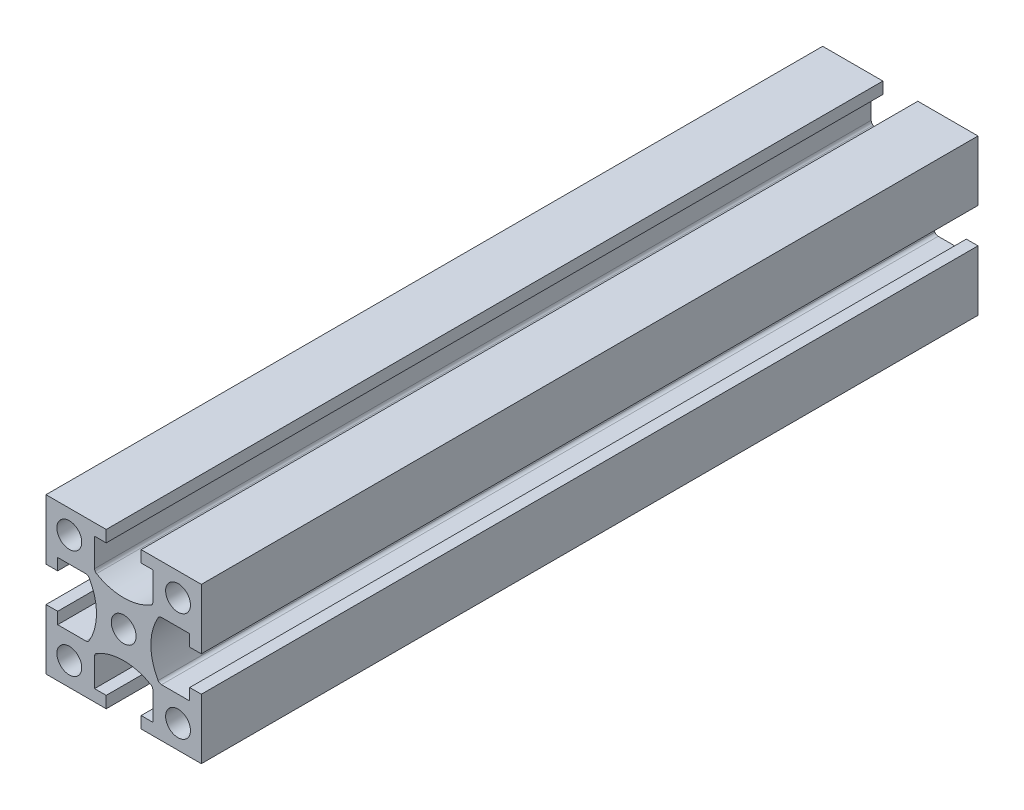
from build123d import *

# Parameters (mm, degrees)
SKETCH_1_R      = 1.6
EXTRUDE_1_DEPTH = 50


with BuildPart() as part:
    # Sketch 1 → Extrude 1 (new, symmetric)
    with BuildSketch(Plane.XY):
        with BuildLine():
            Line((-10, 10), (-2.248585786, 10))
            Line((-2.248585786, 10), (-2.248585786, 8.5))
            Line((-2.248585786, 8.5), (-3.748585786, 8.5))
            Line((-3.748585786, 8.5), (-3.748585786, 4.870834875))
            ThreePointArc((-3.748585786, 4.870834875), (-3.681598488, 4.620834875), (-3.498585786, 4.437822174))
            ThreePointArc((-3.498585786, 4.437822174), (0.001414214, 3.5), (3.501414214, 4.437822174))
            ThreePointArc((3.501414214, 4.437822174), (3.684426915, 4.620834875), (3.751414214, 4.870834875))
            Line((3.751414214, 4.870834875), (3.751414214, 8.5))
            Line((3.751414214, 8.5), (2.251414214, 8.5))
            Line((2.251414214, 8.5), (2.251414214, 10))
            Line((2.251414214, 10), (10, 10))
            Line((10, 10), (10, 2.25))
            Line((10, 2.25), (8.5, 2.25))
            Line((8.5, 2.25), (8.5, 3.75))
            Line((8.5, 3.75), (4.870834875, 3.75))
            ThreePointArc((4.870834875, 3.75), (4.620834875, 3.683012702), (4.437822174, 3.5))
            ThreePointArc((4.437822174, 3.5), (3.5, 0), (4.437822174, -3.5))
            ThreePointArc((4.437822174, -3.5), (4.620834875, -3.683012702), (4.870834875, -3.75))
            Line((4.870834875, -3.75), (8.5, -3.75))
            Line((8.5, -3.75), (8.5, -2.25))
            Line((8.5, -2.25), (10, -2.25))
            Line((10, -2.25), (10, -10))
            Line((10, -10), (2.251414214, -10))
            Line((2.251414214, -10), (2.251414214, -8.5))
            Line((2.251414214, -8.5), (3.751414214, -8.5))
            Line((3.751414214, -8.5), (3.751414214, -4.870834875))
            ThreePointArc((3.751414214, -4.870834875), (3.684426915, -4.620834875), (3.501414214, -4.437822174))
            ThreePointArc((3.501414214, -4.437822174), (0.001414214, -3.5), (-3.498585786, -4.437822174))
            ThreePointArc((-3.498585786, -4.437822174), (-3.681598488, -4.620834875), (-3.748585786, -4.870834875))
            Line((-3.748585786, -4.870834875), (-3.748585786, -8.5))
            Line((-3.748585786, -8.5), (-2.248585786, -8.5))
            Line((-2.248585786, -8.5), (-2.248585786, -10))
            Line((-2.248585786, -10), (-10, -10))
            Line((-10, -10), (-10, -2.25))
            Line((-10, -2.25), (-8.5, -2.25))
            Line((-8.5, -2.25), (-8.5, -3.75))
            Line((-8.5, -3.75), (-4.870834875, -3.75))
            ThreePointArc((-4.870834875, -3.75), (-4.620834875, -3.683012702), (-4.437822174, -3.5))
            ThreePointArc((-4.437822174, -3.5), (-3.5, 0), (-4.437822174, 3.5))
            ThreePointArc((-4.437822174, 3.5), (-4.620834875, 3.683012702), (-4.870834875, 3.75))
            Line((-4.870834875, 3.75), (-8.5, 3.75))
            Line((-8.5, 3.75), (-8.5, 2.25))
            Line((-8.5, 2.25), (-10, 2.25))
            Line((-10, 2.25), (-10, 10))
        make_face()
        with Locations((7, 7)):
            Circle(SKETCH_1_R, mode=Mode.SUBTRACT)
        with Locations((0.001414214, 0)):
            Circle(SKETCH_1_R, mode=Mode.SUBTRACT)
        with Locations((7, -7)):
            Circle(SKETCH_1_R, mode=Mode.SUBTRACT)
        with Locations((-7, -7)):
            Circle(SKETCH_1_R, mode=Mode.SUBTRACT)
        with Locations((-7, 7)):
            Circle(SKETCH_1_R, mode=Mode.SUBTRACT)
    extrude(amount=EXTRUDE_1_DEPTH, both=True)


solid = part.part
